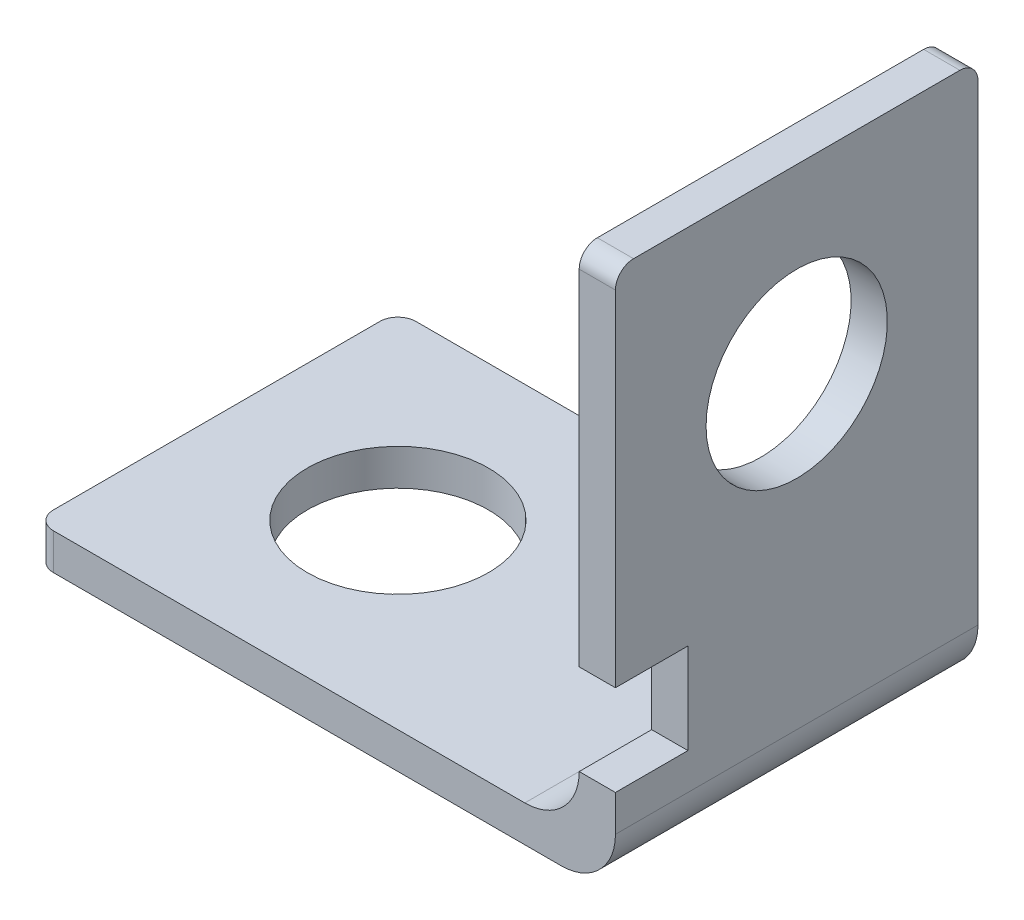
from build123d import *

# Parameters (mm, degrees)
SKETCH1_W           = 32
SKETCH1_H           = 20
BOSS_EXTRUDE1_DEPTH = 2
SKETCH2_R           = 5
CUT_EXTRUDE1_DEPTH  = 13
FILLET1_R           = 1
SKETCH5_W           = 2
SKETCH5_H           = 20
BOSS_EXTRUDE2_DEPTH = 28
FILLET2_R           = 3
SKETCH6_W           = 4
SKETCH6_H           = 5
CUT_EXTRUDE2_DEPTH  = 30
FILLET3_R           = 1
SKETCH7_R           = 5
CUT_EXTRUDE3_DEPTH  = 30


with BuildPart() as part:
    # Sketch1 → Boss-Extrude1 (new body)
    with BuildSketch(Plane(origin=(0, 0, 0), x_dir=(1, 0, 0), z_dir=(0, 1, 0))):
        with Locations((16, -10)):
            Rectangle(SKETCH1_W, SKETCH1_H)
    extrude(amount=BOSS_EXTRUDE1_DEPTH)

    # Sketch2 → Cut-Extrude1 (cut)
    with BuildSketch(Plane(origin=(0, 2, 0), x_dir=(1, 0, 0), z_dir=(0, 1, 0))):
        with Locations(Location((10, -10, 0), (0, 0, 270))):
            Circle(SKETCH2_R)
    extrude(amount=-CUT_EXTRUDE1_DEPTH, mode=Mode.SUBTRACT)

    # Fillet1
    fillet1_edges = [part.edges().sort_by_distance(p)[0] for p in [
        (0, 1, 0),
        (0, 1, 20),
    ]]
    fillet(fillet1_edges, radius=FILLET1_R)

    # Sketch5 → Boss-Extrude2 (add)
    with BuildSketch(Plane(origin=(0, 2, 0), x_dir=(1, 0, 0), z_dir=(0, 1, 0))):
        with Locations((31, -10)):
            Rectangle(SKETCH5_W, SKETCH5_H)
    extrude(amount=BOSS_EXTRUDE2_DEPTH)

    # Fillet2
    fillet2_edges = [part.edges().sort_by_distance(p)[0] for p in [
        (30, 2, 10),
        (32, 0, 10),
    ]]
    fillet(fillet2_edges, radius=FILLET2_R)

    # Sketch6 → Cut-Extrude2 (cut)
    with BuildSketch(Plane.ZY.offset(-30)):
        with Locations((18, 7.5)):
            Rectangle(SKETCH6_W, SKETCH6_H)
    extrude(amount=-CUT_EXTRUDE2_DEPTH, mode=Mode.SUBTRACT)

    # Fillet3
    fillet3_edges = [part.edges().sort_by_distance(p)[0] for p in [
        (31, 30, 0),
        (31, 30, 20),
    ]]
    fillet(fillet3_edges, radius=FILLET3_R)

    # Sketch7 → Cut-Extrude3 (cut)
    with BuildSketch(Plane.ZY.offset(-30)):
        with Locations((10, 20)):
            Circle(SKETCH7_R)
    extrude(amount=-CUT_EXTRUDE3_DEPTH, mode=Mode.SUBTRACT)


solid = part.part
